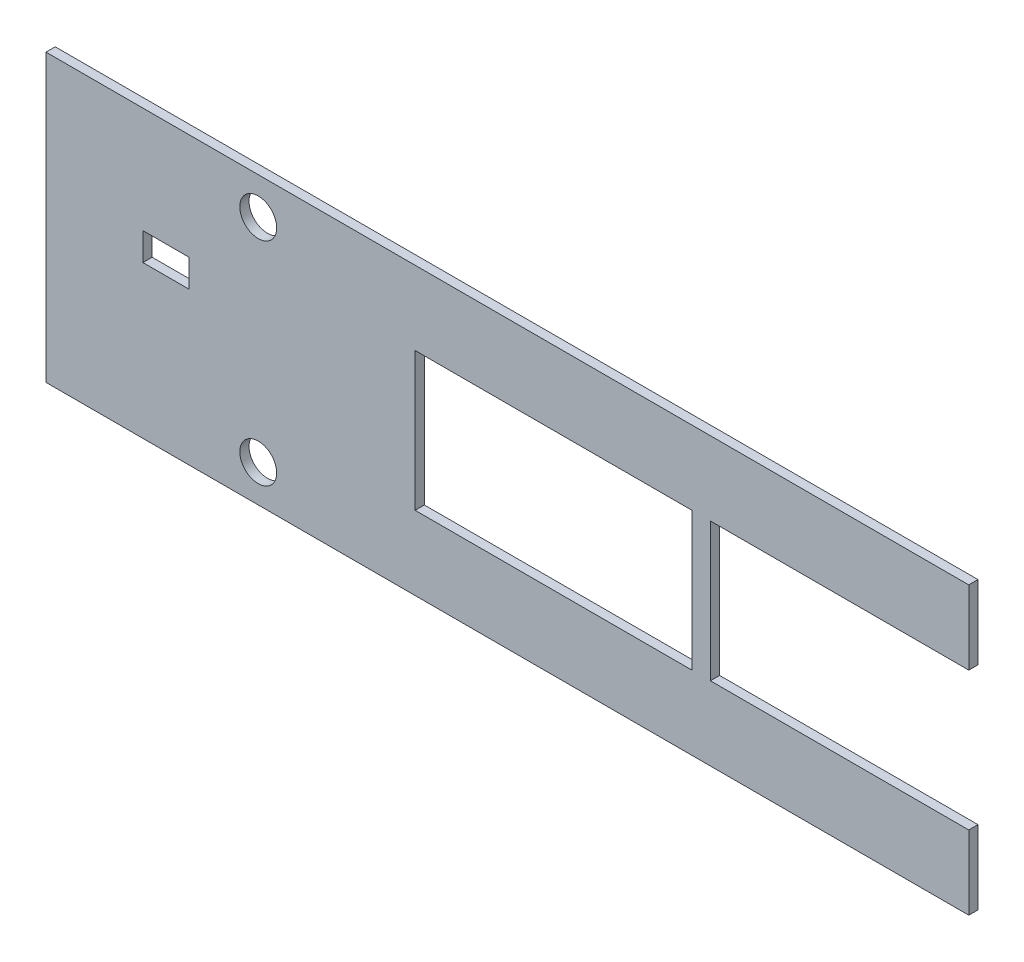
from build123d import *

# Parameters (mm, degrees)
F_2_POSTES_PILOTES_R   = 2
F_2_POSTES_PILOTES_W   = 30
F_2_POSTES_PILOTES_H   = 15
F_2_POSTES_PILOTES_W_2 = 5
F_2_POSTES_PILOTES_H_2 = 3
BOSS_EXTRU_1_DEPTH     = 1


with BuildPart() as part:
    # 2 postes _ pilotes → Boss.-Extru.1 (new body)
    with BuildSketch(Plane.XY):
        Polygon((-40, 23), (60, 23), (60, 15), (32, 15), (32, 0), (60, 0), (60, -8), (-40, -8), align=None)
        with Locations((-17, 19)):
            Circle(F_2_POSTES_PILOTES_R, mode=Mode.SUBTRACT)
        with Locations((-17, -4)):
            Circle(F_2_POSTES_PILOTES_R, mode=Mode.SUBTRACT)
        with Locations((15, 7.5)):
            Rectangle(F_2_POSTES_PILOTES_W, F_2_POSTES_PILOTES_H, mode=Mode.SUBTRACT)
        with Locations((-27, 10)):
            Rectangle(F_2_POSTES_PILOTES_W_2, F_2_POSTES_PILOTES_H_2, mode=Mode.SUBTRACT)
    extrude(amount=BOSS_EXTRU_1_DEPTH)


solid = part.part
